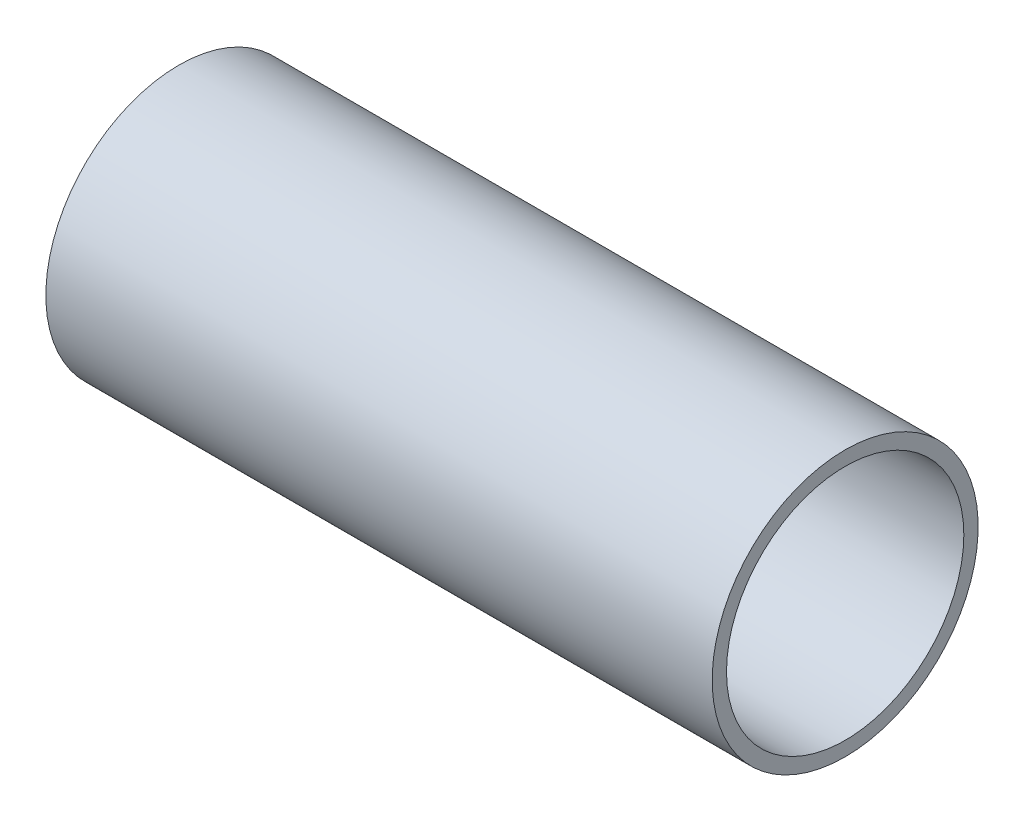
from build123d import *

# Parameters (mm, degrees)
ESQUISSE2_R        = 24.15
ESQUISSE2_R_2      = 21.55
EXTRU_MINCE1_DEPTH = 121


with BuildPart() as part:
    # Esquisse2 → Extru.-Mince1 (new body)
    with BuildSketch(Plane(origin=(557, 0, 0), x_dir=(0, 0, -1), z_dir=(1, 0, 0))):
        with Locations((0, -415)):
            Circle(ESQUISSE2_R)
        with Locations((0, -415)):
            Circle(ESQUISSE2_R_2, mode=Mode.SUBTRACT)
    extrude(amount=EXTRU_MINCE1_DEPTH)


solid = part.part
